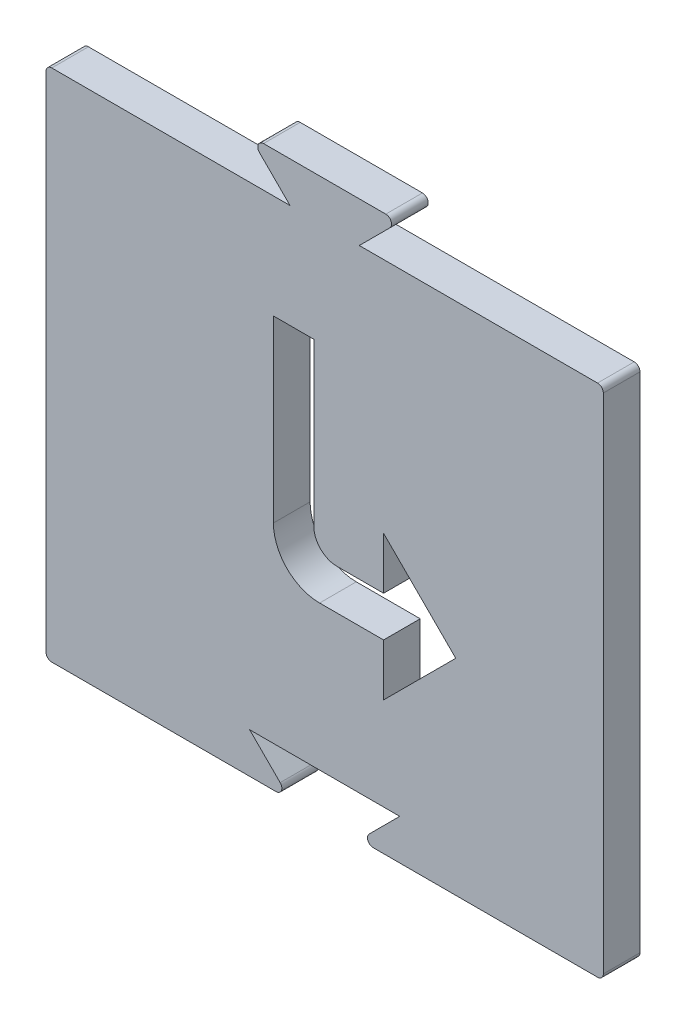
ISO-10303-21;
HEADER;
FILE_DESCRIPTION(('STEP AP214'),'2;1');
FILE_NAME('part.step','',(''),(''),'','','');
FILE_SCHEMA(('AUTOMOTIVE_DESIGN { 1 0 10303 214 1 1 1 1 }'));
ENDSEC;
DATA;
#1=APPLICATION_CONTEXT('core data for automotive mechanical design processes');
#2=APPLICATION_PROTOCOL_DEFINITION('international standard','automotive_design',2000,#1);
#3=PRODUCT_CONTEXT('',#1,'mechanical');
#4=PRODUCT('Part','Part','',(#3));
#5=PRODUCT_RELATED_PRODUCT_CATEGORY('part','',(#4));
#6=PRODUCT_DEFINITION_FORMATION('','',#4);
#7=PRODUCT_DEFINITION_CONTEXT('part definition',#1,'design');
#8=PRODUCT_DEFINITION('design','',#6,#7);
#9=PRODUCT_DEFINITION_SHAPE('','',#8);
#10=(LENGTH_UNIT() NAMED_UNIT(*) SI_UNIT(.MILLI.,.METRE.));
#11=(NAMED_UNIT(*) PLANE_ANGLE_UNIT() SI_UNIT($,.RADIAN.));
#12=(NAMED_UNIT(*) SI_UNIT($,.STERADIAN.) SOLID_ANGLE_UNIT());
#13=UNCERTAINTY_MEASURE_WITH_UNIT(LENGTH_MEASURE(1.E-05),#10,'distance_accuracy_value','');
#14=(GEOMETRIC_REPRESENTATION_CONTEXT(3) GLOBAL_UNCERTAINTY_ASSIGNED_CONTEXT((#13)) GLOBAL_UNIT_ASSIGNED_CONTEXT((#10,
#11,#12)) REPRESENTATION_CONTEXT('',''));
#15=CARTESIAN_POINT('',(0.,0.,0.));
#16=DIRECTION('',(0.,0.,1.));
#17=DIRECTION('',(1.,0.,0.));
#18=AXIS2_PLACEMENT_3D('',#15,#16,#17);
#19=CARTESIAN_POINT('',(0.,0.,3.175));
#20=DIRECTION('',(0.,1.,0.));
#21=DIRECTION('',(0.,0.,1.));
#22=AXIS2_PLACEMENT_3D('',#19,#20,#21);
#23=PLANE('',#22);
#24=DIRECTION('',(1.,0.,0.));
#25=VECTOR('',#24,1.);
#26=CARTESIAN_POINT('',(0.,0.,3.175));
#27=LINE('',#26,#25);
#28=CARTESIAN_POINT('',(0.499999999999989,0.,3.175));
#29=VERTEX_POINT('',#28);
#30=CARTESIAN_POINT('',(19.9228932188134,0.,3.175));
#31=VERTEX_POINT('',#30);
#32=EDGE_CURVE('E320',#29,#31,#27,.T.);
#33=ORIENTED_EDGE('',*,*,#32,.F.);
#34=DIRECTION('',(0.,0.,-1.));
#35=VECTOR('',#34,1.);
#36=CARTESIAN_POINT('',(0.499999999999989,0.,3.175));
#37=LINE('',#36,#35);
#38=CARTESIAN_POINT('',(0.499999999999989,0.,0.));
#39=VERTEX_POINT('',#38);
#40=EDGE_CURVE('E449',#29,#39,#37,.T.);
#41=ORIENTED_EDGE('',*,*,#40,.T.);
#42=DIRECTION('',(1.,0.,0.));
#43=VECTOR('',#42,1.);
#44=CARTESIAN_POINT('',(0.,0.,0.));
#45=LINE('',#44,#43);
#46=CARTESIAN_POINT('',(19.9228932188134,0.,0.));
#47=VERTEX_POINT('',#46);
#48=EDGE_CURVE('E306',#39,#47,#45,.T.);
#49=ORIENTED_EDGE('',*,*,#48,.T.);
#50=DIRECTION('',(0.,0.,-1.));
#51=VECTOR('',#50,1.);
#52=CARTESIAN_POINT('',(19.9228932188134,0.,3.175));
#53=LINE('',#52,#51);
#54=EDGE_CURVE('E447',#47,#31,#53,.F.);
#55=ORIENTED_EDGE('',*,*,#54,.T.);
#56=EDGE_LOOP('',(#33,#41,#49,#55));
#57=FACE_BOUND('',#56,.T.);
#58=ADVANCED_FACE('F32',(#57),#23,.F.);
#59=CARTESIAN_POINT('',(21.13,0.,3.175));
#60=DIRECTION('',(-0.707106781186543,-0.707106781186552,0.));
#61=DIRECTION('',(0.707106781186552,-0.707106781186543,0.));
#62=AXIS2_PLACEMENT_3D('',#59,#60,#61);
#63=PLANE('',#62);
#64=DIRECTION('',(-0.707106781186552,0.707106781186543,0.));
#65=VECTOR('',#64,1.);
#66=CARTESIAN_POINT('',(21.13,0.,3.175));
#67=LINE('',#66,#65);
#68=CARTESIAN_POINT('',(20.2764466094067,0.853553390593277,3.175));
#69=VERTEX_POINT('',#68);
#70=CARTESIAN_POINT('',(17.63,3.5,3.175));
#71=VERTEX_POINT('',#70);
#72=EDGE_CURVE('E324',#69,#71,#67,.T.);
#73=ORIENTED_EDGE('',*,*,#72,.F.);
#74=DIRECTION('',(0.,0.,-1.));
#75=VECTOR('',#74,1.);
#76=CARTESIAN_POINT('',(20.2764466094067,0.853553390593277,3.175));
#77=LINE('',#76,#75);
#78=CARTESIAN_POINT('',(20.2764466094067,0.853553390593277,0.));
#79=VERTEX_POINT('',#78);
#80=EDGE_CURVE('E459',#69,#79,#77,.T.);
#81=ORIENTED_EDGE('',*,*,#80,.T.);
#82=DIRECTION('',(-0.707106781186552,0.707106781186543,0.));
#83=VECTOR('',#82,1.);
#84=CARTESIAN_POINT('',(21.13,0.,0.));
#85=LINE('',#84,#83);
#86=CARTESIAN_POINT('',(17.63,3.5,0.));
#87=VERTEX_POINT('',#86);
#88=EDGE_CURVE('E351',#79,#87,#85,.T.);
#89=ORIENTED_EDGE('',*,*,#88,.T.);
#90=DIRECTION('',(0.,0.,-1.));
#91=VECTOR('',#90,1.);
#92=CARTESIAN_POINT('',(17.63,3.5,3.175));
#93=LINE('',#92,#91);
#94=EDGE_CURVE('E386',#71,#87,#93,.T.);
#95=ORIENTED_EDGE('',*,*,#94,.F.);
#96=EDGE_LOOP('',(#73,#81,#89,#95));
#97=FACE_BOUND('',#96,.T.);
#98=ADVANCED_FACE('F506',(#97),#63,.F.);
#99=CARTESIAN_POINT('',(17.63,3.5,3.175));
#100=DIRECTION('',(0.,1.,0.));
#101=DIRECTION('',(-1.,0.,0.));
#102=AXIS2_PLACEMENT_3D('',#99,#100,#101);
#103=PLANE('',#102);
#104=DIRECTION('',(1.,0.,0.));
#105=VECTOR('',#104,1.);
#106=CARTESIAN_POINT('',(17.63,3.5,0.));
#107=LINE('',#106,#105);
#108=CARTESIAN_POINT('',(30.63,3.5,0.));
#109=VERTEX_POINT('',#108);
#110=EDGE_CURVE('E353',#87,#109,#107,.T.);
#111=ORIENTED_EDGE('',*,*,#110,.T.);
#112=DIRECTION('',(0.,0.,-1.));
#113=VECTOR('',#112,1.);
#114=CARTESIAN_POINT('',(30.63,3.5,3.175));
#115=LINE('',#114,#113);
#116=CARTESIAN_POINT('',(30.63,3.5,3.175));
#117=VERTEX_POINT('',#116);
#118=EDGE_CURVE('E383',#117,#109,#115,.T.);
#119=ORIENTED_EDGE('',*,*,#118,.F.);
#120=DIRECTION('',(1.,0.,0.));
#121=VECTOR('',#120,1.);
#122=CARTESIAN_POINT('',(17.63,3.5,3.175));
#123=LINE('',#122,#121);
#124=EDGE_CURVE('E326',#71,#117,#123,.T.);
#125=ORIENTED_EDGE('',*,*,#124,.F.);
#126=ORIENTED_EDGE('',*,*,#94,.T.);
#127=EDGE_LOOP('',(#111,#119,#125,#126));
#128=FACE_BOUND('',#127,.T.);
#129=ADVANCED_FACE('F512',(#128),#103,.F.);
#130=CARTESIAN_POINT('',(30.63,3.5,3.175));
#131=DIRECTION('',(0.707106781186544,-0.707106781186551,0.));
#132=DIRECTION('',(0.707106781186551,0.707106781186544,0.));
#133=AXIS2_PLACEMENT_3D('',#130,#131,#132);
#134=PLANE('',#133);
#135=DIRECTION('',(-0.707106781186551,-0.707106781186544,0.));
#136=VECTOR('',#135,1.);
#137=CARTESIAN_POINT('',(30.63,3.5,0.));
#138=LINE('',#137,#136);
#139=CARTESIAN_POINT('',(27.9835533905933,0.853553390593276,0.));
#140=VERTEX_POINT('',#139);
#141=EDGE_CURVE('E355',#109,#140,#138,.T.);
#142=ORIENTED_EDGE('',*,*,#141,.T.);
#143=DIRECTION('',(0.,0.,-1.));
#144=VECTOR('',#143,1.);
#145=CARTESIAN_POINT('',(27.9835533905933,0.853553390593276,3.175));
#146=LINE('',#145,#144);
#147=CARTESIAN_POINT('',(27.9835533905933,0.853553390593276,3.175));
#148=VERTEX_POINT('',#147);
#149=EDGE_CURVE('E457',#140,#148,#146,.F.);
#150=ORIENTED_EDGE('',*,*,#149,.T.);
#151=DIRECTION('',(-0.707106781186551,-0.707106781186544,0.));
#152=VECTOR('',#151,1.);
#153=CARTESIAN_POINT('',(30.63,3.5,3.175));
#154=LINE('',#153,#152);
#155=EDGE_CURVE('E328',#117,#148,#154,.T.);
#156=ORIENTED_EDGE('',*,*,#155,.F.);
#157=ORIENTED_EDGE('',*,*,#118,.T.);
#158=EDGE_LOOP('',(#142,#150,#156,#157));
#159=FACE_BOUND('',#158,.T.);
#160=ADVANCED_FACE('F799',(#159),#134,.F.);
#161=CARTESIAN_POINT('',(27.13,0.,3.175));
#162=DIRECTION('',(0.,1.,0.));
#163=DIRECTION('',(-1.,0.,0.));
#164=AXIS2_PLACEMENT_3D('',#161,#162,#163);
#165=PLANE('',#164);
#166=DIRECTION('',(1.,0.,0.));
#167=VECTOR('',#166,1.);
#168=CARTESIAN_POINT('',(27.13,0.,0.));
#169=LINE('',#168,#167);
#170=CARTESIAN_POINT('',(28.3371067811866,0.,0.));
#171=VERTEX_POINT('',#170);
#172=CARTESIAN_POINT('',(47.76,0.,0.));
#173=VERTEX_POINT('',#172);
#174=EDGE_CURVE('E358',#171,#173,#169,.T.);
#175=ORIENTED_EDGE('',*,*,#174,.T.);
#176=DIRECTION('',(0.,0.,-1.));
#177=VECTOR('',#176,1.);
#178=CARTESIAN_POINT('',(47.76,0.,3.175));
#179=LINE('',#178,#177);
#180=CARTESIAN_POINT('',(47.76,0.,3.175));
#181=VERTEX_POINT('',#180);
#182=EDGE_CURVE('E430',#173,#181,#179,.F.);
#183=ORIENTED_EDGE('',*,*,#182,.T.);
#184=DIRECTION('',(1.,0.,0.));
#185=VECTOR('',#184,1.);
#186=CARTESIAN_POINT('',(27.13,0.,3.175));
#187=LINE('',#186,#185);
#188=CARTESIAN_POINT('',(28.3371067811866,0.,3.175));
#189=VERTEX_POINT('',#188);
#190=EDGE_CURVE('E331',#189,#181,#187,.T.);
#191=ORIENTED_EDGE('',*,*,#190,.F.);
#192=DIRECTION('',(0.,0.,-1.));
#193=VECTOR('',#192,1.);
#194=CARTESIAN_POINT('',(28.3371067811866,0.,3.175));
#195=LINE('',#194,#193);
#196=EDGE_CURVE('E427',#189,#171,#195,.T.);
#197=ORIENTED_EDGE('',*,*,#196,.T.);
#198=EDGE_LOOP('',(#175,#183,#191,#197));
#199=FACE_BOUND('',#198,.T.);
#200=ADVANCED_FACE('F523',(#199),#165,.F.);
#201=CARTESIAN_POINT('',(48.26,44.56,3.175));
#202=DIRECTION('',(-1.,0.,0.));
#203=DIRECTION('',(0.,-1.,0.));
#204=AXIS2_PLACEMENT_3D('',#201,#202,#203);
#205=PLANE('',#204);
#206=DIRECTION('',(0.,1.,0.));
#207=VECTOR('',#206,1.);
#208=CARTESIAN_POINT('',(48.26,35.56,3.175));
#209=LINE('',#208,#207);
#210=CARTESIAN_POINT('',(48.26,0.500000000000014,3.175));
#211=VERTEX_POINT('',#210);
#212=CARTESIAN_POINT('',(48.26,44.06,3.175));
#213=VERTEX_POINT('',#212);
#214=EDGE_CURVE('E334',#211,#213,#209,.T.);
#215=ORIENTED_EDGE('',*,*,#214,.F.);
#216=DIRECTION('',(0.,0.,-1.));
#217=VECTOR('',#216,1.);
#218=CARTESIAN_POINT('',(48.26,0.5,3.175));
#219=LINE('',#218,#217);
#220=CARTESIAN_POINT('',(48.26,0.5,0.));
#221=VERTEX_POINT('',#220);
#222=EDGE_CURVE('E408',#211,#221,#219,.T.);
#223=ORIENTED_EDGE('',*,*,#222,.T.);
#224=DIRECTION('',(0.,1.,0.));
#225=VECTOR('',#224,1.);
#226=CARTESIAN_POINT('',(48.26,44.56,0.));
#227=LINE('',#226,#225);
#228=CARTESIAN_POINT('',(48.26,44.06,0.));
#229=VERTEX_POINT('',#228);
#230=EDGE_CURVE('E361',#221,#229,#227,.T.);
#231=ORIENTED_EDGE('',*,*,#230,.T.);
#232=DIRECTION('',(0.,0.,-1.));
#233=VECTOR('',#232,1.);
#234=CARTESIAN_POINT('',(48.26,44.06,3.175));
#235=LINE('',#234,#233);
#236=EDGE_CURVE('E406',#229,#213,#235,.F.);
#237=ORIENTED_EDGE('',*,*,#236,.T.);
#238=EDGE_LOOP('',(#215,#223,#231,#237));
#239=FACE_BOUND('',#238,.T.);
#240=ADVANCED_FACE('F532',(#239),#205,.F.);
#241=CARTESIAN_POINT('',(27.13,44.56,3.175));
#242=DIRECTION('',(0.,-1.,0.));
#243=DIRECTION('',(1.,0.,0.));
#244=AXIS2_PLACEMENT_3D('',#241,#242,#243);
#245=PLANE('',#244);
#246=DIRECTION('',(-1.,0.,0.));
#247=VECTOR('',#246,1.);
#248=CARTESIAN_POINT('',(27.13,44.56,3.175));
#249=LINE('',#248,#247);
#250=CARTESIAN_POINT('',(47.76,44.56,3.175));
#251=VERTEX_POINT('',#250);
#252=CARTESIAN_POINT('',(27.13,44.56,3.175));
#253=VERTEX_POINT('',#252);
#254=EDGE_CURVE('E337',#251,#253,#249,.T.);
#255=ORIENTED_EDGE('',*,*,#254,.F.);
#256=DIRECTION('',(0.,0.,-1.));
#257=VECTOR('',#256,1.);
#258=CARTESIAN_POINT('',(47.76,44.56,3.175));
#259=LINE('',#258,#257);
#260=CARTESIAN_POINT('',(47.76,44.56,0.));
#261=VERTEX_POINT('',#260);
#262=EDGE_CURVE('E462',#251,#261,#259,.T.);
#263=ORIENTED_EDGE('',*,*,#262,.T.);
#264=DIRECTION('',(-1.,0.,0.));
#265=VECTOR('',#264,1.);
#266=CARTESIAN_POINT('',(27.13,44.56,0.));
#267=LINE('',#266,#265);
#268=CARTESIAN_POINT('',(27.13,44.56,0.));
#269=VERTEX_POINT('',#268);
#270=EDGE_CURVE('E364',#261,#269,#267,.T.);
#271=ORIENTED_EDGE('',*,*,#270,.T.);
#272=DIRECTION('',(0.,0.,-1.));
#273=VECTOR('',#272,1.);
#274=CARTESIAN_POINT('',(27.13,44.56,3.175));
#275=LINE('',#274,#273);
#276=EDGE_CURVE('E380',#253,#269,#275,.T.);
#277=ORIENTED_EDGE('',*,*,#276,.F.);
#278=EDGE_LOOP('',(#255,#263,#271,#277));
#279=FACE_BOUND('',#278,.T.);
#280=ADVANCED_FACE('F541',(#279),#245,.F.);
#281=CARTESIAN_POINT('',(30.63,48.06,3.175));
#282=DIRECTION('',(-0.707106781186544,0.707106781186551,0.));
#283=DIRECTION('',(-0.707106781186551,-0.707106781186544,0.));
#284=AXIS2_PLACEMENT_3D('',#281,#282,#283);
#285=PLANE('',#284);
#286=DIRECTION('',(0.707106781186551,0.707106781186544,0.));
#287=VECTOR('',#286,1.);
#288=CARTESIAN_POINT('',(30.63,48.06,0.));
#289=LINE('',#288,#287);
#290=CARTESIAN_POINT('',(29.7764466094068,47.2064466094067,0.));
#291=VERTEX_POINT('',#290);
#292=EDGE_CURVE('E366',#269,#291,#289,.T.);
#293=ORIENTED_EDGE('',*,*,#292,.T.);
#294=DIRECTION('',(0.,0.,-1.));
#295=VECTOR('',#294,1.);
#296=CARTESIAN_POINT('',(29.7764466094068,47.2064466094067,3.175));
#297=LINE('',#296,#295);
#298=CARTESIAN_POINT('',(29.7764466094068,47.2064466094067,3.175));
#299=VERTEX_POINT('',#298);
#300=EDGE_CURVE('E470',#291,#299,#297,.F.);
#301=ORIENTED_EDGE('',*,*,#300,.T.);
#302=DIRECTION('',(0.707106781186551,0.707106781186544,0.));
#303=VECTOR('',#302,1.);
#304=CARTESIAN_POINT('',(30.63,48.06,3.175));
#305=LINE('',#304,#303);
#306=EDGE_CURVE('E339',#253,#299,#305,.T.);
#307=ORIENTED_EDGE('',*,*,#306,.F.);
#308=ORIENTED_EDGE('',*,*,#276,.T.);
#309=EDGE_LOOP('',(#293,#301,#307,#308));
#310=FACE_BOUND('',#309,.T.);
#311=ADVANCED_FACE('F546',(#310),#285,.F.);
#312=CARTESIAN_POINT('',(17.6299999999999,48.06,3.175));
#313=DIRECTION('',(0.,-1.,0.));
#314=DIRECTION('',(0.,0.,-1.));
#315=AXIS2_PLACEMENT_3D('',#312,#313,#314);
#316=PLANE('',#315);
#317=DIRECTION('',(-1.,0.,0.));
#318=VECTOR('',#317,1.);
#319=CARTESIAN_POINT('',(17.6299999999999,48.06,3.175));
#320=LINE('',#319,#318);
#321=CARTESIAN_POINT('',(29.4228932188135,48.06,3.175));
#322=VERTEX_POINT('',#321);
#323=CARTESIAN_POINT('',(18.8371067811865,48.06,3.175));
#324=VERTEX_POINT('',#323);
#325=EDGE_CURVE('E342',#322,#324,#320,.T.);
#326=ORIENTED_EDGE('',*,*,#325,.F.);
#327=DIRECTION('',(0.,0.,-1.));
#328=VECTOR('',#327,1.);
#329=CARTESIAN_POINT('',(29.4228932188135,48.06,3.175));
#330=LINE('',#329,#328);
#331=CARTESIAN_POINT('',(29.4228932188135,48.06,0.));
#332=VERTEX_POINT('',#331);
#333=EDGE_CURVE('E467',#322,#332,#330,.T.);
#334=ORIENTED_EDGE('',*,*,#333,.T.);
#335=DIRECTION('',(-1.,0.,0.));
#336=VECTOR('',#335,1.);
#337=CARTESIAN_POINT('',(17.6299999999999,48.06,0.));
#338=LINE('',#337,#336);
#339=CARTESIAN_POINT('',(18.8371067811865,48.06,0.));
#340=VERTEX_POINT('',#339);
#341=EDGE_CURVE('E369',#332,#340,#338,.T.);
#342=ORIENTED_EDGE('',*,*,#341,.T.);
#343=DIRECTION('',(0.,0.,-1.));
#344=VECTOR('',#343,1.);
#345=CARTESIAN_POINT('',(18.8371067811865,48.06,3.175));
#346=LINE('',#345,#344);
#347=EDGE_CURVE('E465',#340,#324,#346,.F.);
#348=ORIENTED_EDGE('',*,*,#347,.T.);
#349=EDGE_LOOP('',(#326,#334,#342,#348));
#350=FACE_BOUND('',#349,.T.);
#351=ADVANCED_FACE('F554',(#350),#316,.F.);
#352=CARTESIAN_POINT('',(21.13,44.56,3.175));
#353=DIRECTION('',(0.707106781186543,0.707106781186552,0.));
#354=DIRECTION('',(-0.707106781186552,0.707106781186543,0.));
#355=AXIS2_PLACEMENT_3D('',#352,#353,#354);
#356=PLANE('',#355);
#357=DIRECTION('',(0.707106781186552,-0.707106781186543,0.));
#358=VECTOR('',#357,1.);
#359=CARTESIAN_POINT('',(21.13,44.56,3.175));
#360=LINE('',#359,#358);
#361=CARTESIAN_POINT('',(18.4835533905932,47.2064466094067,3.175));
#362=VERTEX_POINT('',#361);
#363=CARTESIAN_POINT('',(21.13,44.56,3.175));
#364=VERTEX_POINT('',#363);
#365=EDGE_CURVE('E344',#362,#364,#360,.T.);
#366=ORIENTED_EDGE('',*,*,#365,.F.);
#367=DIRECTION('',(0.,0.,-1.));
#368=VECTOR('',#367,1.);
#369=CARTESIAN_POINT('',(18.4835533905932,47.2064466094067,3.175));
#370=LINE('',#369,#368);
#371=CARTESIAN_POINT('',(18.4835533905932,47.2064466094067,0.));
#372=VERTEX_POINT('',#371);
#373=EDGE_CURVE('E40',#362,#372,#370,.T.);
#374=ORIENTED_EDGE('',*,*,#373,.T.);
#375=DIRECTION('',(0.707106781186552,-0.707106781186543,0.));
#376=VECTOR('',#375,1.);
#377=CARTESIAN_POINT('',(21.13,44.56,0.));
#378=LINE('',#377,#376);
#379=CARTESIAN_POINT('',(21.13,44.56,0.));
#380=VERTEX_POINT('',#379);
#381=EDGE_CURVE('E372',#372,#380,#378,.T.);
#382=ORIENTED_EDGE('',*,*,#381,.T.);
#383=DIRECTION('',(0.,0.,-1.));
#384=VECTOR('',#383,1.);
#385=CARTESIAN_POINT('',(21.13,44.56,3.175));
#386=LINE('',#385,#384);
#387=EDGE_CURVE('E348',#364,#380,#386,.T.);
#388=ORIENTED_EDGE('',*,*,#387,.F.);
#389=EDGE_LOOP('',(#366,#374,#382,#388));
#390=FACE_BOUND('',#389,.T.);
#391=ADVANCED_FACE('F475',(#390),#356,.F.);
#392=CARTESIAN_POINT('',(0.,44.56,3.175));
#393=DIRECTION('',(0.,-1.,0.));
#394=DIRECTION('',(0.,0.,-1.));
#395=AXIS2_PLACEMENT_3D('',#392,#393,#394);
#396=PLANE('',#395);
#397=DIRECTION('',(-1.,0.,0.));
#398=VECTOR('',#397,1.);
#399=CARTESIAN_POINT('',(0.,44.56,0.));
#400=LINE('',#399,#398);
#401=CARTESIAN_POINT('',(0.5,44.56,0.));
#402=VERTEX_POINT('',#401);
#403=EDGE_CURVE('E374',#380,#402,#400,.T.);
#404=ORIENTED_EDGE('',*,*,#403,.T.);
#405=DIRECTION('',(0.,0.,-1.));
#406=VECTOR('',#405,1.);
#407=CARTESIAN_POINT('',(0.5,44.56,3.175));
#408=LINE('',#407,#406);
#409=CARTESIAN_POINT('',(0.5,44.56,3.175));
#410=VERTEX_POINT('',#409);
#411=EDGE_CURVE('E11',#402,#410,#408,.F.);
#412=ORIENTED_EDGE('',*,*,#411,.T.);
#413=DIRECTION('',(-1.,0.,0.));
#414=VECTOR('',#413,1.);
#415=CARTESIAN_POINT('',(0.,44.56,3.175));
#416=LINE('',#415,#414);
#417=EDGE_CURVE('E346',#364,#410,#416,.T.);
#418=ORIENTED_EDGE('',*,*,#417,.F.);
#419=ORIENTED_EDGE('',*,*,#387,.T.);
#420=EDGE_LOOP('',(#404,#412,#418,#419));
#421=FACE_BOUND('',#420,.T.);
#422=ADVANCED_FACE('F482',(#421),#396,.F.);
#423=CARTESIAN_POINT('',(0.,35.56,3.175));
#424=DIRECTION('',(1.,0.,0.));
#425=DIRECTION('',(0.,1.,0.));
#426=AXIS2_PLACEMENT_3D('',#423,#424,#425);
#427=PLANE('',#426);
#428=DIRECTION('',(0.,-1.,0.));
#429=VECTOR('',#428,1.);
#430=CARTESIAN_POINT('',(0.,35.56,0.));
#431=LINE('',#430,#429);
#432=CARTESIAN_POINT('',(0.,44.06,0.));
#433=VERTEX_POINT('',#432);
#434=CARTESIAN_POINT('',(0.,0.5,0.));
#435=VERTEX_POINT('',#434);
#436=EDGE_CURVE('E321',#433,#435,#431,.T.);
#437=ORIENTED_EDGE('',*,*,#436,.T.);
#438=DIRECTION('',(0.,0.,-1.));
#439=VECTOR('',#438,1.);
#440=CARTESIAN_POINT('',(0.,0.5,3.175));
#441=LINE('',#440,#439);
#442=CARTESIAN_POINT('',(0.,0.5,3.175));
#443=VERTEX_POINT('',#442);
#444=EDGE_CURVE('E455',#435,#443,#441,.F.);
#445=ORIENTED_EDGE('',*,*,#444,.T.);
#446=DIRECTION('',(0.,-1.,0.));
#447=VECTOR('',#446,1.);
#448=CARTESIAN_POINT('',(0.,35.56,3.175));
#449=LINE('',#448,#447);
#450=CARTESIAN_POINT('',(0.,44.06,3.175));
#451=VERTEX_POINT('',#450);
#452=EDGE_CURVE('E317',#451,#443,#449,.T.);
#453=ORIENTED_EDGE('',*,*,#452,.F.);
#454=DIRECTION('',(0.,0.,-1.));
#455=VECTOR('',#454,1.);
#456=CARTESIAN_POINT('',(0.,44.06,3.175));
#457=LINE('',#456,#455);
#458=EDGE_CURVE('E452',#451,#433,#457,.T.);
#459=ORIENTED_EDGE('',*,*,#458,.T.);
#460=EDGE_LOOP('',(#437,#445,#453,#459));
#461=FACE_BOUND('',#460,.T.);
#462=ADVANCED_FACE('F490',(#461),#427,.F.);
#463=CARTESIAN_POINT('',(0.,0.,3.175));
#464=DIRECTION('',(0.,0.,1.));
#465=DIRECTION('',(1.,0.,0.));
#466=AXIS2_PLACEMENT_3D('',#463,#464,#465);
#467=PLANE('',#466);
#468=DIRECTION('',(0.,1.,0.));
#469=VECTOR('',#468,1.);
#470=CARTESIAN_POINT('',(23.1925810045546,35.56,3.175));
#471=LINE('',#470,#469);
#472=CARTESIAN_POINT('',(23.1925810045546,21.53,3.175));
#473=VERTEX_POINT('',#472);
#474=CARTESIAN_POINT('',(23.1925810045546,35.56,3.175));
#475=VERTEX_POINT('',#474);
#476=EDGE_CURVE('E264',#473,#475,#471,.T.);
#477=ORIENTED_EDGE('',*,*,#476,.F.);
#478=CARTESIAN_POINT('',(25.1925810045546,21.53,3.175));
#479=DIRECTION('',(0.,0.,1.));
#480=DIRECTION('',(1.,0.,0.));
#481=AXIS2_PLACEMENT_3D('',#478,#479,#480);
#482=CIRCLE('',#481,2.);
#483=CARTESIAN_POINT('',(25.1925810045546,19.53,3.175));
#484=VERTEX_POINT('',#483);
#485=EDGE_CURVE('E392',#473,#484,#482,.T.);
#486=ORIENTED_EDGE('',*,*,#485,.T.);
#487=DIRECTION('',(-1.,0.,0.));
#488=VECTOR('',#487,1.);
#489=CARTESIAN_POINT('',(23.1925810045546,19.53,3.175));
#490=LINE('',#489,#488);
#491=CARTESIAN_POINT('',(29.2314832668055,19.53,3.175));
#492=VERTEX_POINT('',#491);
#493=EDGE_CURVE('E266',#492,#484,#490,.T.);
#494=ORIENTED_EDGE('',*,*,#493,.F.);
#495=DIRECTION('',(0.,-1.,0.));
#496=VECTOR('',#495,1.);
#497=CARTESIAN_POINT('',(29.2314832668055,19.53,3.175));
#498=LINE('',#497,#496);
#499=CARTESIAN_POINT('',(29.2314832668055,24.03,3.175));
#500=VERTEX_POINT('',#499);
#501=EDGE_CURVE('E299',#500,#492,#498,.T.);
#502=ORIENTED_EDGE('',*,*,#501,.F.);
#503=DIRECTION('',(-0.707106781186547,0.707106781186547,0.));
#504=VECTOR('',#503,1.);
#505=CARTESIAN_POINT('',(29.2314832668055,24.03,3.175));
#506=LINE('',#505,#504);
#507=CARTESIAN_POINT('',(35.4814832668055,17.78,3.175));
#508=VERTEX_POINT('',#507);
#509=EDGE_CURVE('E296',#508,#500,#506,.T.);
#510=ORIENTED_EDGE('',*,*,#509,.F.);
#511=DIRECTION('',(0.707106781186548,0.707106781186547,0.));
#512=VECTOR('',#511,1.);
#513=CARTESIAN_POINT('',(35.4814832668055,17.78,3.175));
#514=LINE('',#513,#512);
#515=CARTESIAN_POINT('',(29.2314832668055,11.53,3.175));
#516=VERTEX_POINT('',#515);
#517=EDGE_CURVE('E293',#516,#508,#514,.T.);
#518=ORIENTED_EDGE('',*,*,#517,.F.);
#519=DIRECTION('',(0.,-1.,0.));
#520=VECTOR('',#519,1.);
#521=CARTESIAN_POINT('',(29.2314832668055,11.53,3.175));
#522=LINE('',#521,#520);
#523=CARTESIAN_POINT('',(29.2314832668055,16.03,3.175));
#524=VERTEX_POINT('',#523);
#525=EDGE_CURVE('E290',#524,#516,#522,.T.);
#526=ORIENTED_EDGE('',*,*,#525,.F.);
#527=DIRECTION('',(1.,0.,0.));
#528=VECTOR('',#527,1.);
#529=CARTESIAN_POINT('',(29.2314832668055,16.03,3.175));
#530=LINE('',#529,#528);
#531=CARTESIAN_POINT('',(23.6925810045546,16.03,3.175));
#532=VERTEX_POINT('',#531);
#533=EDGE_CURVE('E288',#532,#524,#530,.T.);
#534=ORIENTED_EDGE('',*,*,#533,.F.);
#535=CARTESIAN_POINT('',(23.6925810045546,20.03,3.175));
#536=DIRECTION('',(0.,0.,1.));
#537=DIRECTION('',(1.,0.,0.));
#538=AXIS2_PLACEMENT_3D('',#535,#536,#537);
#539=CIRCLE('',#538,4.);
#540=CARTESIAN_POINT('',(19.6925810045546,20.03,3.175));
#541=VERTEX_POINT('',#540);
#542=EDGE_CURVE('E402',#532,#541,#539,.F.);
#543=ORIENTED_EDGE('',*,*,#542,.T.);
#544=DIRECTION('',(0.,-1.,0.));
#545=VECTOR('',#544,1.);
#546=CARTESIAN_POINT('',(19.6925810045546,16.03,3.175));
#547=LINE('',#546,#545);
#548=CARTESIAN_POINT('',(19.6925810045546,35.56,3.175));
#549=VERTEX_POINT('',#548);
#550=EDGE_CURVE('E286',#549,#541,#547,.T.);
#551=ORIENTED_EDGE('',*,*,#550,.F.);
#552=DIRECTION('',(-1.,0.,0.));
#553=VECTOR('',#552,1.);
#554=CARTESIAN_POINT('',(19.6925810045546,35.56,3.175));
#555=LINE('',#554,#553);
#556=EDGE_CURVE('E243',#475,#549,#555,.T.);
#557=ORIENTED_EDGE('',*,*,#556,.F.);
#558=EDGE_LOOP('',(#477,#486,#494,#502,#510,#518,#526,#534,#543,#551,#557));
#559=FACE_BOUND('',#558,.T.);
#560=ORIENTED_EDGE('',*,*,#190,.T.);
#561=CARTESIAN_POINT('',(47.76,0.5,3.175));
#562=DIRECTION('',(0.,0.,1.));
#563=DIRECTION('',(1.,0.,0.));
#564=AXIS2_PLACEMENT_3D('',#561,#562,#563);
#565=CIRCLE('',#564,0.5);
#566=EDGE_CURVE('E445',#181,#211,#565,.T.);
#567=ORIENTED_EDGE('',*,*,#566,.T.);
#568=ORIENTED_EDGE('',*,*,#214,.T.);
#569=CARTESIAN_POINT('',(47.76,44.06,3.175));
#570=DIRECTION('',(0.,0.,1.));
#571=DIRECTION('',(1.,0.,0.));
#572=AXIS2_PLACEMENT_3D('',#569,#570,#571);
#573=CIRCLE('',#572,0.5);
#574=EDGE_CURVE('E437',#213,#251,#573,.T.);
#575=ORIENTED_EDGE('',*,*,#574,.T.);
#576=ORIENTED_EDGE('',*,*,#254,.T.);
#577=ORIENTED_EDGE('',*,*,#306,.T.);
#578=CARTESIAN_POINT('',(29.4228932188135,47.56,3.175));
#579=DIRECTION('',(0.,0.,1.));
#580=DIRECTION('',(1.,0.,0.));
#581=AXIS2_PLACEMENT_3D('',#578,#579,#580);
#582=CIRCLE('',#581,0.5);
#583=EDGE_CURVE('E435',#299,#322,#582,.T.);
#584=ORIENTED_EDGE('',*,*,#583,.T.);
#585=ORIENTED_EDGE('',*,*,#325,.T.);
#586=CARTESIAN_POINT('',(18.8371067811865,47.56,3.175));
#587=DIRECTION('',(0.,0.,1.));
#588=DIRECTION('',(1.,0.,0.));
#589=AXIS2_PLACEMENT_3D('',#586,#587,#588);
#590=CIRCLE('',#589,0.5);
#591=EDGE_CURVE('E53',#324,#362,#590,.T.);
#592=ORIENTED_EDGE('',*,*,#591,.T.);
#593=ORIENTED_EDGE('',*,*,#365,.T.);
#594=ORIENTED_EDGE('',*,*,#417,.T.);
#595=CARTESIAN_POINT('',(0.5,44.06,3.175));
#596=DIRECTION('',(0.,0.,1.));
#597=DIRECTION('',(1.,0.,0.));
#598=AXIS2_PLACEMENT_3D('',#595,#596,#597);
#599=CIRCLE('',#598,0.5);
#600=EDGE_CURVE('E432',#410,#451,#599,.T.);
#601=ORIENTED_EDGE('',*,*,#600,.T.);
#602=ORIENTED_EDGE('',*,*,#452,.T.);
#603=CARTESIAN_POINT('',(0.499999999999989,0.5,3.175));
#604=DIRECTION('',(0.,0.,1.));
#605=DIRECTION('',(1.,0.,0.));
#606=AXIS2_PLACEMENT_3D('',#603,#604,#605);
#607=CIRCLE('',#606,0.5);
#608=EDGE_CURVE('E443',#443,#29,#607,.T.);
#609=ORIENTED_EDGE('',*,*,#608,.T.);
#610=ORIENTED_EDGE('',*,*,#32,.T.);
#611=CARTESIAN_POINT('',(19.9228932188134,0.5,3.175));
#612=DIRECTION('',(0.,0.,1.));
#613=DIRECTION('',(1.,0.,0.));
#614=AXIS2_PLACEMENT_3D('',#611,#612,#613);
#615=CIRCLE('',#614,0.5);
#616=EDGE_CURVE('E439',#31,#69,#615,.T.);
#617=ORIENTED_EDGE('',*,*,#616,.T.);
#618=ORIENTED_EDGE('',*,*,#72,.T.);
#619=ORIENTED_EDGE('',*,*,#124,.T.);
#620=ORIENTED_EDGE('',*,*,#155,.T.);
#621=CARTESIAN_POINT('',(28.3371067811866,0.500000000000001,3.175));
#622=DIRECTION('',(0.,0.,1.));
#623=DIRECTION('',(1.,0.,0.));
#624=AXIS2_PLACEMENT_3D('',#621,#622,#623);
#625=CIRCLE('',#624,0.5);
#626=EDGE_CURVE('E441',#148,#189,#625,.T.);
#627=ORIENTED_EDGE('',*,*,#626,.T.);
#628=EDGE_LOOP('',(#560,#567,#568,#575,#576,#577,#584,#585,#592,#593,#594,#601,#602,#609,#610,
#617,#618,#619,#620,#627));
#629=FACE_BOUND('',#628,.T.);
#630=ADVANCED_FACE('F487',(#559,#629),#467,.T.);
#631=CARTESIAN_POINT('',(0.,0.,0.));
#632=DIRECTION('',(0.,0.,1.));
#633=DIRECTION('',(1.,0.,0.));
#634=AXIS2_PLACEMENT_3D('',#631,#632,#633);
#635=PLANE('',#634);
#636=DIRECTION('',(-1.,0.,0.));
#637=VECTOR('',#636,1.);
#638=CARTESIAN_POINT('',(23.1925810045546,19.53,0.));
#639=LINE('',#638,#637);
#640=CARTESIAN_POINT('',(29.2314832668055,19.53,0.));
#641=VERTEX_POINT('',#640);
#642=CARTESIAN_POINT('',(25.1925810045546,19.53,0.));
#643=VERTEX_POINT('',#642);
#644=EDGE_CURVE('E282',#641,#643,#639,.T.);
#645=ORIENTED_EDGE('',*,*,#644,.T.);
#646=CARTESIAN_POINT('',(25.1925810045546,21.53,0.));
#647=DIRECTION('',(0.,0.,1.));
#648=DIRECTION('',(1.,0.,0.));
#649=AXIS2_PLACEMENT_3D('',#646,#647,#648);
#650=CIRCLE('',#649,2.);
#651=CARTESIAN_POINT('',(23.1925810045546,21.53,0.));
#652=VERTEX_POINT('',#651);
#653=EDGE_CURVE('E396',#643,#652,#650,.F.);
#654=ORIENTED_EDGE('',*,*,#653,.T.);
#655=DIRECTION('',(0.,1.,0.));
#656=VECTOR('',#655,1.);
#657=CARTESIAN_POINT('',(23.1925810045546,35.56,0.));
#658=LINE('',#657,#656);
#659=CARTESIAN_POINT('',(23.1925810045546,35.56,0.));
#660=VERTEX_POINT('',#659);
#661=EDGE_CURVE('E248',#652,#660,#658,.T.);
#662=ORIENTED_EDGE('',*,*,#661,.T.);
#663=DIRECTION('',(-1.,0.,0.));
#664=VECTOR('',#663,1.);
#665=CARTESIAN_POINT('',(19.6925810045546,35.56,0.));
#666=LINE('',#665,#664);
#667=CARTESIAN_POINT('',(19.6925810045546,35.56,0.));
#668=VERTEX_POINT('',#667);
#669=EDGE_CURVE('E241',#660,#668,#666,.T.);
#670=ORIENTED_EDGE('',*,*,#669,.T.);
#671=DIRECTION('',(0.,-1.,0.));
#672=VECTOR('',#671,1.);
#673=CARTESIAN_POINT('',(19.6925810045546,16.03,0.));
#674=LINE('',#673,#672);
#675=CARTESIAN_POINT('',(19.6925810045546,20.03,0.));
#676=VERTEX_POINT('',#675);
#677=EDGE_CURVE('E251',#668,#676,#674,.T.);
#678=ORIENTED_EDGE('',*,*,#677,.T.);
#679=CARTESIAN_POINT('',(23.6925810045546,20.03,0.));
#680=DIRECTION('',(0.,0.,1.));
#681=DIRECTION('',(1.,0.,0.));
#682=AXIS2_PLACEMENT_3D('',#679,#680,#681);
#683=CIRCLE('',#682,4.);
#684=CARTESIAN_POINT('',(23.6925810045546,16.03,0.));
#685=VERTEX_POINT('',#684);
#686=EDGE_CURVE('E404',#676,#685,#683,.T.);
#687=ORIENTED_EDGE('',*,*,#686,.T.);
#688=DIRECTION('',(1.,0.,0.));
#689=VECTOR('',#688,1.);
#690=CARTESIAN_POINT('',(29.2314832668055,16.03,0.));
#691=LINE('',#690,#689);
#692=CARTESIAN_POINT('',(29.2314832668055,16.03,0.));
#693=VERTEX_POINT('',#692);
#694=EDGE_CURVE('E257',#685,#693,#691,.T.);
#695=ORIENTED_EDGE('',*,*,#694,.T.);
#696=DIRECTION('',(0.,-1.,0.));
#697=VECTOR('',#696,1.);
#698=CARTESIAN_POINT('',(29.2314832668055,11.53,0.));
#699=LINE('',#698,#697);
#700=CARTESIAN_POINT('',(29.2314832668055,11.53,0.));
#701=VERTEX_POINT('',#700);
#702=EDGE_CURVE('E270',#693,#701,#699,.T.);
#703=ORIENTED_EDGE('',*,*,#702,.T.);
#704=DIRECTION('',(0.707106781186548,0.707106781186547,0.));
#705=VECTOR('',#704,1.);
#706=CARTESIAN_POINT('',(35.4814832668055,17.78,0.));
#707=LINE('',#706,#705);
#708=CARTESIAN_POINT('',(35.4814832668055,17.78,0.));
#709=VERTEX_POINT('',#708);
#710=EDGE_CURVE('E273',#701,#709,#707,.T.);
#711=ORIENTED_EDGE('',*,*,#710,.T.);
#712=DIRECTION('',(-0.707106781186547,0.707106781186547,0.));
#713=VECTOR('',#712,1.);
#714=CARTESIAN_POINT('',(29.2314832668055,24.03,0.));
#715=LINE('',#714,#713);
#716=CARTESIAN_POINT('',(29.2314832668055,24.03,0.));
#717=VERTEX_POINT('',#716);
#718=EDGE_CURVE('E276',#709,#717,#715,.T.);
#719=ORIENTED_EDGE('',*,*,#718,.T.);
#720=DIRECTION('',(0.,-1.,0.));
#721=VECTOR('',#720,1.);
#722=CARTESIAN_POINT('',(29.2314832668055,19.53,0.));
#723=LINE('',#722,#721);
#724=EDGE_CURVE('E279',#717,#641,#723,.T.);
#725=ORIENTED_EDGE('',*,*,#724,.T.);
#726=EDGE_LOOP('',(#645,#654,#662,#670,#678,#687,#695,#703,#711,#719,#725));
#727=FACE_BOUND('',#726,.T.);
#728=ORIENTED_EDGE('',*,*,#230,.F.);
#729=CARTESIAN_POINT('',(47.76,0.5,0.));
#730=DIRECTION('',(0.,0.,1.));
#731=DIRECTION('',(1.,0.,0.));
#732=AXIS2_PLACEMENT_3D('',#729,#730,#731);
#733=CIRCLE('',#732,0.5);
#734=EDGE_CURVE('E425',#221,#173,#733,.F.);
#735=ORIENTED_EDGE('',*,*,#734,.T.);
#736=ORIENTED_EDGE('',*,*,#174,.F.);
#737=CARTESIAN_POINT('',(28.3371067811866,0.500000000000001,0.));
#738=DIRECTION('',(0.,0.,1.));
#739=DIRECTION('',(1.,0.,0.));
#740=AXIS2_PLACEMENT_3D('',#737,#738,#739);
#741=CIRCLE('',#740,0.5);
#742=EDGE_CURVE('E421',#171,#140,#741,.F.);
#743=ORIENTED_EDGE('',*,*,#742,.T.);
#744=ORIENTED_EDGE('',*,*,#141,.F.);
#745=ORIENTED_EDGE('',*,*,#110,.F.);
#746=ORIENTED_EDGE('',*,*,#88,.F.);
#747=CARTESIAN_POINT('',(19.9228932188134,0.5,0.));
#748=DIRECTION('',(0.,0.,1.));
#749=DIRECTION('',(1.,0.,0.));
#750=AXIS2_PLACEMENT_3D('',#747,#748,#749);
#751=CIRCLE('',#750,0.5);
#752=EDGE_CURVE('E419',#79,#47,#751,.F.);
#753=ORIENTED_EDGE('',*,*,#752,.T.);
#754=ORIENTED_EDGE('',*,*,#48,.F.);
#755=CARTESIAN_POINT('',(0.499999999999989,0.5,0.));
#756=DIRECTION('',(0.,0.,1.));
#757=DIRECTION('',(1.,0.,0.));
#758=AXIS2_PLACEMENT_3D('',#755,#756,#757);
#759=CIRCLE('',#758,0.5);
#760=EDGE_CURVE('E423',#39,#435,#759,.F.);
#761=ORIENTED_EDGE('',*,*,#760,.T.);
#762=ORIENTED_EDGE('',*,*,#436,.F.);
#763=CARTESIAN_POINT('',(0.5,44.06,0.));
#764=DIRECTION('',(0.,0.,1.));
#765=DIRECTION('',(1.,0.,0.));
#766=AXIS2_PLACEMENT_3D('',#763,#764,#765);
#767=CIRCLE('',#766,0.5);
#768=EDGE_CURVE('E411',#433,#402,#767,.F.);
#769=ORIENTED_EDGE('',*,*,#768,.T.);
#770=ORIENTED_EDGE('',*,*,#403,.F.);
#771=ORIENTED_EDGE('',*,*,#381,.F.);
#772=CARTESIAN_POINT('',(18.8371067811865,47.56,0.));
#773=DIRECTION('',(0.,0.,1.));
#774=DIRECTION('',(1.,0.,0.));
#775=AXIS2_PLACEMENT_3D('',#772,#773,#774);
#776=CIRCLE('',#775,0.5);
#777=EDGE_CURVE('E413',#372,#340,#776,.F.);
#778=ORIENTED_EDGE('',*,*,#777,.T.);
#779=ORIENTED_EDGE('',*,*,#341,.F.);
#780=CARTESIAN_POINT('',(29.4228932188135,47.56,0.));
#781=DIRECTION('',(0.,0.,1.));
#782=DIRECTION('',(1.,0.,0.));
#783=AXIS2_PLACEMENT_3D('',#780,#781,#782);
#784=CIRCLE('',#783,0.5);
#785=EDGE_CURVE('E415',#332,#291,#784,.F.);
#786=ORIENTED_EDGE('',*,*,#785,.T.);
#787=ORIENTED_EDGE('',*,*,#292,.F.);
#788=ORIENTED_EDGE('',*,*,#270,.F.);
#789=CARTESIAN_POINT('',(47.76,44.06,0.));
#790=DIRECTION('',(0.,0.,1.));
#791=DIRECTION('',(1.,0.,0.));
#792=AXIS2_PLACEMENT_3D('',#789,#790,#791);
#793=CIRCLE('',#792,0.5);
#794=EDGE_CURVE('E417',#261,#229,#793,.F.);
#795=ORIENTED_EDGE('',*,*,#794,.T.);
#796=EDGE_LOOP('',(#728,#735,#736,#743,#744,#745,#746,#753,#754,#761,#762,#769,#770,#771,#778,
#779,#786,#787,#788,#795));
#797=FACE_BOUND('',#796,.T.);
#798=ADVANCED_FACE('F260',(#727,#797),#635,.F.);
#799=CARTESIAN_POINT('',(19.6925810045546,35.56,0.));
#800=DIRECTION('',(0.,1.,0.));
#801=DIRECTION('',(0.,0.,1.));
#802=AXIS2_PLACEMENT_3D('',#799,#800,#801);
#803=PLANE('',#802);
#804=ORIENTED_EDGE('',*,*,#556,.T.);
#805=DIRECTION('',(0.,0.,1.));
#806=VECTOR('',#805,1.);
#807=CARTESIAN_POINT('',(19.6925810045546,35.56,0.));
#808=LINE('',#807,#806);
#809=EDGE_CURVE('E236',#668,#549,#808,.T.);
#810=ORIENTED_EDGE('',*,*,#809,.F.);
#811=ORIENTED_EDGE('',*,*,#669,.F.);
#812=DIRECTION('',(0.,0.,1.));
#813=VECTOR('',#812,1.);
#814=CARTESIAN_POINT('',(23.1925810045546,35.56,0.));
#815=LINE('',#814,#813);
#816=EDGE_CURVE('E304',#660,#475,#815,.T.);
#817=ORIENTED_EDGE('',*,*,#816,.T.);
#818=EDGE_LOOP('',(#804,#810,#811,#817));
#819=FACE_BOUND('',#818,.T.);
#820=ADVANCED_FACE('F238',(#819),#803,.F.);
#821=CARTESIAN_POINT('',(23.1925810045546,35.56,0.));
#822=DIRECTION('',(1.,0.,0.));
#823=DIRECTION('',(0.,0.,-1.));
#824=AXIS2_PLACEMENT_3D('',#821,#822,#823);
#825=PLANE('',#824);
#826=ORIENTED_EDGE('',*,*,#661,.F.);
#827=DIRECTION('',(0.,0.,1.));
#828=VECTOR('',#827,1.);
#829=CARTESIAN_POINT('',(23.1925810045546,21.53,0.));
#830=LINE('',#829,#828);
#831=EDGE_CURVE('E389',#652,#473,#830,.T.);
#832=ORIENTED_EDGE('',*,*,#831,.T.);
#833=ORIENTED_EDGE('',*,*,#476,.T.);
#834=ORIENTED_EDGE('',*,*,#816,.F.);
#835=EDGE_LOOP('',(#826,#832,#833,#834));
#836=FACE_BOUND('',#835,.T.);
#837=ADVANCED_FACE('F703',(#836),#825,.F.);
#838=CARTESIAN_POINT('',(23.1925810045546,19.53,0.));
#839=DIRECTION('',(0.,1.,0.));
#840=DIRECTION('',(-1.,0.,0.));
#841=AXIS2_PLACEMENT_3D('',#838,#839,#840);
#842=PLANE('',#841);
#843=ORIENTED_EDGE('',*,*,#493,.T.);
#844=DIRECTION('',(0.,0.,1.));
#845=VECTOR('',#844,1.);
#846=CARTESIAN_POINT('',(25.1925810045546,19.53,0.));
#847=LINE('',#846,#845);
#848=EDGE_CURVE('E394',#484,#643,#847,.F.);
#849=ORIENTED_EDGE('',*,*,#848,.T.);
#850=ORIENTED_EDGE('',*,*,#644,.F.);
#851=DIRECTION('',(0.,0.,1.));
#852=VECTOR('',#851,1.);
#853=CARTESIAN_POINT('',(29.2314832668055,19.53,0.));
#854=LINE('',#853,#852);
#855=EDGE_CURVE('E307',#641,#492,#854,.T.);
#856=ORIENTED_EDGE('',*,*,#855,.T.);
#857=EDGE_LOOP('',(#843,#849,#850,#856));
#858=FACE_BOUND('',#857,.T.);
#859=ADVANCED_FACE('F694',(#858),#842,.F.);
#860=CARTESIAN_POINT('',(29.2314832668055,19.53,0.));
#861=DIRECTION('',(-1.,0.,0.));
#862=DIRECTION('',(0.,0.,1.));
#863=AXIS2_PLACEMENT_3D('',#860,#861,#862);
#864=PLANE('',#863);
#865=ORIENTED_EDGE('',*,*,#501,.T.);
#866=ORIENTED_EDGE('',*,*,#855,.F.);
#867=ORIENTED_EDGE('',*,*,#724,.F.);
#868=DIRECTION('',(0.,0.,1.));
#869=VECTOR('',#868,1.);
#870=CARTESIAN_POINT('',(29.2314832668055,24.03,0.));
#871=LINE('',#870,#869);
#872=EDGE_CURVE('E309',#717,#500,#871,.T.);
#873=ORIENTED_EDGE('',*,*,#872,.T.);
#874=EDGE_LOOP('',(#865,#866,#867,#873));
#875=FACE_BOUND('',#874,.T.);
#876=ADVANCED_FACE('F685',(#875),#864,.F.);
#877=CARTESIAN_POINT('',(29.2314832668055,24.03,0.));
#878=DIRECTION('',(0.707106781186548,0.707106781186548,0.));
#879=DIRECTION('',(-0.707106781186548,0.707106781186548,0.));
#880=AXIS2_PLACEMENT_3D('',#877,#878,#879);
#881=PLANE('',#880);
#882=ORIENTED_EDGE('',*,*,#509,.T.);
#883=ORIENTED_EDGE('',*,*,#872,.F.);
#884=ORIENTED_EDGE('',*,*,#718,.F.);
#885=DIRECTION('',(0.,0.,1.));
#886=VECTOR('',#885,1.);
#887=CARTESIAN_POINT('',(35.4814832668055,17.78,0.));
#888=LINE('',#887,#886);
#889=EDGE_CURVE('E311',#709,#508,#888,.T.);
#890=ORIENTED_EDGE('',*,*,#889,.T.);
#891=EDGE_LOOP('',(#882,#883,#884,#890));
#892=FACE_BOUND('',#891,.T.);
#893=ADVANCED_FACE('F676',(#892),#881,.F.);
#894=CARTESIAN_POINT('',(35.4814832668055,17.78,0.));
#895=DIRECTION('',(0.707106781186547,-0.707106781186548,0.));
#896=DIRECTION('',(0.707106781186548,0.707106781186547,0.));
#897=AXIS2_PLACEMENT_3D('',#894,#895,#896);
#898=PLANE('',#897);
#899=ORIENTED_EDGE('',*,*,#517,.T.);
#900=ORIENTED_EDGE('',*,*,#889,.F.);
#901=ORIENTED_EDGE('',*,*,#710,.F.);
#902=DIRECTION('',(0.,0.,1.));
#903=VECTOR('',#902,1.);
#904=CARTESIAN_POINT('',(29.2314832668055,11.53,0.));
#905=LINE('',#904,#903);
#906=EDGE_CURVE('E313',#701,#516,#905,.T.);
#907=ORIENTED_EDGE('',*,*,#906,.T.);
#908=EDGE_LOOP('',(#899,#900,#901,#907));
#909=FACE_BOUND('',#908,.T.);
#910=ADVANCED_FACE('F666',(#909),#898,.F.);
#911=CARTESIAN_POINT('',(29.2314832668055,11.53,0.));
#912=DIRECTION('',(-1.,0.,0.));
#913=DIRECTION('',(0.,-1.,0.));
#914=AXIS2_PLACEMENT_3D('',#911,#912,#913);
#915=PLANE('',#914);
#916=ORIENTED_EDGE('',*,*,#525,.T.);
#917=ORIENTED_EDGE('',*,*,#906,.F.);
#918=ORIENTED_EDGE('',*,*,#702,.F.);
#919=DIRECTION('',(0.,0.,1.));
#920=VECTOR('',#919,1.);
#921=CARTESIAN_POINT('',(29.2314832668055,16.03,0.));
#922=LINE('',#921,#920);
#923=EDGE_CURVE('E247',#693,#524,#922,.T.);
#924=ORIENTED_EDGE('',*,*,#923,.T.);
#925=EDGE_LOOP('',(#916,#917,#918,#924));
#926=FACE_BOUND('',#925,.T.);
#927=ADVANCED_FACE('F657',(#926),#915,.F.);
#928=CARTESIAN_POINT('',(29.2314832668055,16.03,0.));
#929=DIRECTION('',(0.,-1.,0.));
#930=DIRECTION('',(0.,0.,-1.));
#931=AXIS2_PLACEMENT_3D('',#928,#929,#930);
#932=PLANE('',#931);
#933=ORIENTED_EDGE('',*,*,#694,.F.);
#934=DIRECTION('',(0.,0.,1.));
#935=VECTOR('',#934,1.);
#936=CARTESIAN_POINT('',(23.6925810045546,16.03,3.175));
#937=LINE('',#936,#935);
#938=EDGE_CURVE('E398',#685,#532,#937,.T.);
#939=ORIENTED_EDGE('',*,*,#938,.T.);
#940=ORIENTED_EDGE('',*,*,#533,.T.);
#941=ORIENTED_EDGE('',*,*,#923,.F.);
#942=EDGE_LOOP('',(#933,#939,#940,#941));
#943=FACE_BOUND('',#942,.T.);
#944=ADVANCED_FACE('F650',(#943),#932,.F.);
#945=CARTESIAN_POINT('',(19.6925810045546,16.03,0.));
#946=DIRECTION('',(-1.,0.,0.));
#947=DIRECTION('',(0.,0.,1.));
#948=AXIS2_PLACEMENT_3D('',#945,#946,#947);
#949=PLANE('',#948);
#950=ORIENTED_EDGE('',*,*,#550,.T.);
#951=DIRECTION('',(0.,0.,1.));
#952=VECTOR('',#951,1.);
#953=CARTESIAN_POINT('',(19.6925810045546,20.03,0.));
#954=LINE('',#953,#952);
#955=EDGE_CURVE('E254',#541,#676,#954,.F.);
#956=ORIENTED_EDGE('',*,*,#955,.T.);
#957=ORIENTED_EDGE('',*,*,#677,.F.);
#958=ORIENTED_EDGE('',*,*,#809,.T.);
#959=EDGE_LOOP('',(#950,#956,#957,#958));
#960=FACE_BOUND('',#959,.T.);
#961=ADVANCED_FACE('F252',(#960),#949,.F.);
#962=CARTESIAN_POINT('',(25.1925810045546,21.53,0.));
#963=DIRECTION('',(0.,0.,1.));
#964=DIRECTION('',(1.,0.,0.));
#965=AXIS2_PLACEMENT_3D('',#962,#963,#964);
#966=CYLINDRICAL_SURFACE('',#965,2.);
#967=ORIENTED_EDGE('',*,*,#653,.F.);
#968=ORIENTED_EDGE('',*,*,#848,.F.);
#969=ORIENTED_EDGE('',*,*,#485,.F.);
#970=ORIENTED_EDGE('',*,*,#831,.F.);
#971=EDGE_LOOP('',(#967,#968,#969,#970));
#972=FACE_BOUND('',#971,.T.);
#973=ADVANCED_FACE('F571',(#972),#966,.T.);
#974=CARTESIAN_POINT('',(23.6925810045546,20.03,0.));
#975=DIRECTION('',(0.,0.,-1.));
#976=DIRECTION('',(-1.,0.,0.));
#977=AXIS2_PLACEMENT_3D('',#974,#975,#976);
#978=CYLINDRICAL_SURFACE('',#977,4.);
#979=ORIENTED_EDGE('',*,*,#686,.F.);
#980=ORIENTED_EDGE('',*,*,#955,.F.);
#981=ORIENTED_EDGE('',*,*,#542,.F.);
#982=ORIENTED_EDGE('',*,*,#938,.F.);
#983=EDGE_LOOP('',(#979,#980,#981,#982));
#984=FACE_BOUND('',#983,.T.);
#985=ADVANCED_FACE('F574',(#984),#978,.F.);
#986=CARTESIAN_POINT('',(47.76,0.5,3.175));
#987=DIRECTION('',(0.,0.,-1.));
#988=DIRECTION('',(-1.,0.,0.));
#989=AXIS2_PLACEMENT_3D('',#986,#987,#988);
#990=CYLINDRICAL_SURFACE('',#989,0.5);
#991=ORIENTED_EDGE('',*,*,#566,.F.);
#992=ORIENTED_EDGE('',*,*,#182,.F.);
#993=ORIENTED_EDGE('',*,*,#734,.F.);
#994=ORIENTED_EDGE('',*,*,#222,.F.);
#995=EDGE_LOOP('',(#991,#992,#993,#994));
#996=FACE_BOUND('',#995,.T.);
#997=ADVANCED_FACE('F529',(#996),#990,.T.);
#998=CARTESIAN_POINT('',(0.499999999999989,0.5,3.175));
#999=DIRECTION('',(0.,0.,-1.));
#1000=DIRECTION('',(-1.,0.,0.));
#1001=AXIS2_PLACEMENT_3D('',#998,#999,#1000);
#1002=CYLINDRICAL_SURFACE('',#1001,0.5);
#1003=ORIENTED_EDGE('',*,*,#608,.F.);
#1004=ORIENTED_EDGE('',*,*,#444,.F.);
#1005=ORIENTED_EDGE('',*,*,#760,.F.);
#1006=ORIENTED_EDGE('',*,*,#40,.F.);
#1007=EDGE_LOOP('',(#1003,#1004,#1005,#1006));
#1008=FACE_BOUND('',#1007,.T.);
#1009=ADVANCED_FACE('F493',(#1008),#1002,.T.);
#1010=CARTESIAN_POINT('',(28.3371067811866,0.500000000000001,3.175));
#1011=DIRECTION('',(0.,0.,-1.));
#1012=DIRECTION('',(-1.,0.,0.));
#1013=AXIS2_PLACEMENT_3D('',#1010,#1011,#1012);
#1014=CYLINDRICAL_SURFACE('',#1013,0.5);
#1015=ORIENTED_EDGE('',*,*,#626,.F.);
#1016=ORIENTED_EDGE('',*,*,#149,.F.);
#1017=ORIENTED_EDGE('',*,*,#742,.F.);
#1018=ORIENTED_EDGE('',*,*,#196,.F.);
#1019=EDGE_LOOP('',(#1015,#1016,#1017,#1018));
#1020=FACE_BOUND('',#1019,.T.);
#1021=ADVANCED_FACE('F520',(#1020),#1014,.T.);
#1022=CARTESIAN_POINT('',(19.9228932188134,0.5,3.175));
#1023=DIRECTION('',(0.,0.,-1.));
#1024=DIRECTION('',(-1.,0.,0.));
#1025=AXIS2_PLACEMENT_3D('',#1022,#1023,#1024);
#1026=CYLINDRICAL_SURFACE('',#1025,0.5);
#1027=ORIENTED_EDGE('',*,*,#616,.F.);
#1028=ORIENTED_EDGE('',*,*,#54,.F.);
#1029=ORIENTED_EDGE('',*,*,#752,.F.);
#1030=ORIENTED_EDGE('',*,*,#80,.F.);
#1031=EDGE_LOOP('',(#1027,#1028,#1029,#1030));
#1032=FACE_BOUND('',#1031,.T.);
#1033=ADVANCED_FACE('F501',(#1032),#1026,.T.);
#1034=CARTESIAN_POINT('',(47.76,44.06,3.175));
#1035=DIRECTION('',(0.,0.,-1.));
#1036=DIRECTION('',(-1.,0.,0.));
#1037=AXIS2_PLACEMENT_3D('',#1034,#1035,#1036);
#1038=CYLINDRICAL_SURFACE('',#1037,0.5);
#1039=ORIENTED_EDGE('',*,*,#574,.F.);
#1040=ORIENTED_EDGE('',*,*,#236,.F.);
#1041=ORIENTED_EDGE('',*,*,#794,.F.);
#1042=ORIENTED_EDGE('',*,*,#262,.F.);
#1043=EDGE_LOOP('',(#1039,#1040,#1041,#1042));
#1044=FACE_BOUND('',#1043,.T.);
#1045=ADVANCED_FACE('F538',(#1044),#1038,.T.);
#1046=CARTESIAN_POINT('',(29.4228932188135,47.56,3.175));
#1047=DIRECTION('',(0.,0.,-1.));
#1048=DIRECTION('',(-1.,0.,0.));
#1049=AXIS2_PLACEMENT_3D('',#1046,#1047,#1048);
#1050=CYLINDRICAL_SURFACE('',#1049,0.5);
#1051=ORIENTED_EDGE('',*,*,#583,.F.);
#1052=ORIENTED_EDGE('',*,*,#300,.F.);
#1053=ORIENTED_EDGE('',*,*,#785,.F.);
#1054=ORIENTED_EDGE('',*,*,#333,.F.);
#1055=EDGE_LOOP('',(#1051,#1052,#1053,#1054));
#1056=FACE_BOUND('',#1055,.T.);
#1057=ADVANCED_FACE('F550',(#1056),#1050,.T.);
#1058=CARTESIAN_POINT('',(18.8371067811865,47.56,3.175));
#1059=DIRECTION('',(0.,0.,-1.));
#1060=DIRECTION('',(-1.,0.,0.));
#1061=AXIS2_PLACEMENT_3D('',#1058,#1059,#1060);
#1062=CYLINDRICAL_SURFACE('',#1061,0.5);
#1063=ORIENTED_EDGE('',*,*,#591,.F.);
#1064=ORIENTED_EDGE('',*,*,#347,.F.);
#1065=ORIENTED_EDGE('',*,*,#777,.F.);
#1066=ORIENTED_EDGE('',*,*,#373,.F.);
#1067=EDGE_LOOP('',(#1063,#1064,#1065,#1066));
#1068=FACE_BOUND('',#1067,.T.);
#1069=ADVANCED_FACE('F556',(#1068),#1062,.T.);
#1070=CARTESIAN_POINT('',(0.5,44.06,3.175));
#1071=DIRECTION('',(0.,0.,-1.));
#1072=DIRECTION('',(-1.,0.,0.));
#1073=AXIS2_PLACEMENT_3D('',#1070,#1071,#1072);
#1074=CYLINDRICAL_SURFACE('',#1073,0.5);
#1075=ORIENTED_EDGE('',*,*,#600,.F.);
#1076=ORIENTED_EDGE('',*,*,#411,.F.);
#1077=ORIENTED_EDGE('',*,*,#768,.F.);
#1078=ORIENTED_EDGE('',*,*,#458,.F.);
#1079=EDGE_LOOP('',(#1075,#1076,#1077,#1078));
#1080=FACE_BOUND('',#1079,.T.);
#1081=ADVANCED_FACE('F34',(#1080),#1074,.T.);
#1082=CLOSED_SHELL('',(#58,#98,#129,#160,#200,#240,#280,#311,#351,#391,#422,#462,#630,#798,#820,
#837,#859,#876,#893,#910,#927,#944,#961,#973,#985,#997,#1009,#1021,#1033,#1045,#1057,#1069,#1081));
#1083=MANIFOLD_SOLID_BREP('B2',#1082);
#1084=ADVANCED_BREP_SHAPE_REPRESENTATION('',(#18,#1083),#14);
#1085=SHAPE_DEFINITION_REPRESENTATION(#9,#1084);
ENDSEC;
END-ISO-10303-21;
